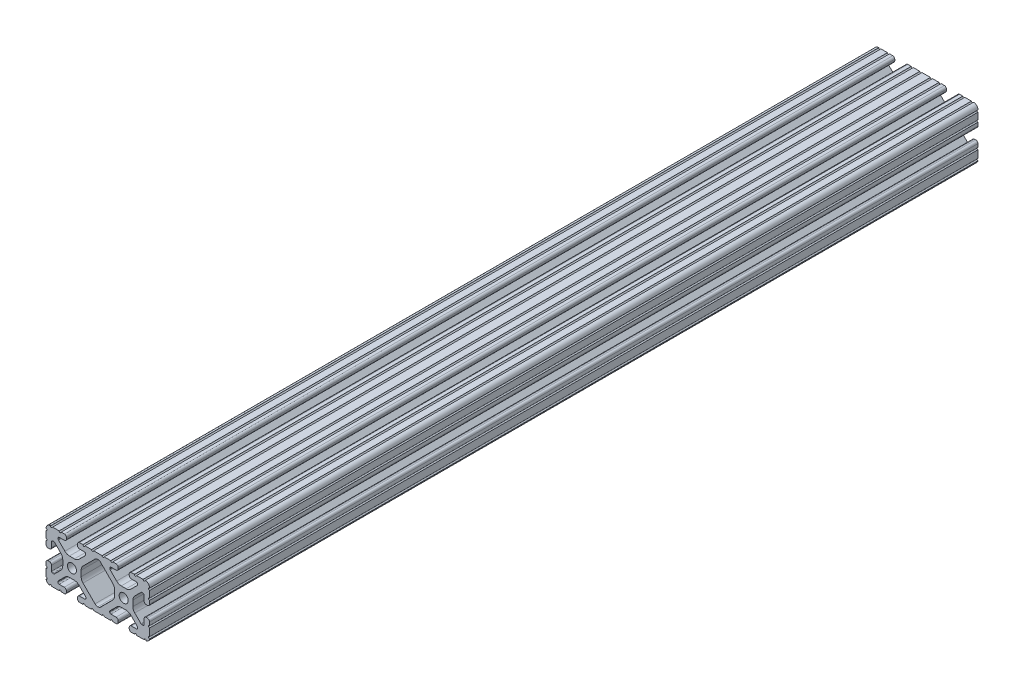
from build123d import *

# Parameters (mm, degrees)
SKETCH1_R      = 3.3274
EXTRUDE1_DEPTH = 609.6
SKETCH3_R      = 3.571875
EXTRUDE3_DEPTH = 76.2


with BuildPart() as part:
    # Sketch1 → Extrude1 (new body)
    with BuildSketch(Plane.XY):
        with BuildLine():
            Line((37.1900335, 54.320138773), (37.1900335, 54.882716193))
            ThreePointArc((37.1900335, 54.882716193), (37.450415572, 55.511334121), (38.0790335, 55.771716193))
            Line((38.0790335, 55.771716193), (41.685477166, 55.771716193))
            ThreePointArc((41.685477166, 55.771716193), (42.799028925, 56.232964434), (43.260277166, 57.346516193))
            Line((43.260277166, 57.346516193), (43.260277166, 58.282488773))
            ThreePointArc((43.260277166, 58.282488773), (42.805347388, 59.380786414), (41.707049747, 59.835716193))
            Line((41.707049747, 59.835716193), (39.271813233, 59.835716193))
            ThreePointArc((39.271813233, 59.835716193), (38.509813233, 59.073716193), (37.747813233, 59.835716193))
            Line((37.747813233, 59.835716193), (32.919398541, 59.835716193))
            ThreePointArc((32.919398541, 59.835716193), (32.157398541, 59.073716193), (31.395398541, 59.835716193))
            Line((31.395398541, 59.835716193), (25.153155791, 59.835716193))
            ThreePointArc((25.153155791, 59.835716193), (24.391155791, 59.073716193), (23.629155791, 59.835716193))
            Line((23.629155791, 59.835716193), (18.800741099, 59.835716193))
            ThreePointArc((18.800741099, 59.835716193), (18.038741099, 59.073716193), (17.276741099, 59.835716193))
            Line((17.276741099, 59.835716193), (14.841504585, 59.835716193))
            ThreePointArc((14.841504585, 59.835716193), (13.743206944, 59.380786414), (13.288277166, 58.282488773))
            Line((13.288277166, 58.282488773), (13.288277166, 57.346516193))
            ThreePointArc((13.288277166, 57.346516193), (13.749525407, 56.232964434), (14.863077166, 55.771716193))
            Line((14.863077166, 55.771716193), (18.469520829, 55.771716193))
            ThreePointArc((18.469520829, 55.771716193), (19.098138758, 55.511334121), (19.358520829, 54.882716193))
            Line((19.358520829, 54.882716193), (19.358520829, 54.320138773))
            ThreePointArc((19.358520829, 54.320138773), (19.290850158, 53.979934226), (19.098140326, 53.691522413))
            Line((19.098140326, 53.691522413), (14.421778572, 49.015137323))
            ThreePointArc((14.421778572, 49.015137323), (12.880829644, 47.985503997), (11.063154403, 47.623944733))
            Line((11.063154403, 47.623944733), (7.38539993, 47.623944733))
            ThreePointArc((7.38539993, 47.623944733), (5.567724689, 47.985503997), (4.026775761, 49.015137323))
            Line((4.026775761, 49.015137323), (-0.649585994, 53.691522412))
            ThreePointArc((-0.649585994, 53.691522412), (-0.842295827, 53.979934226), (-0.909966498, 54.320138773))
            Line((-0.909966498, 54.320138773), (-0.909966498, 54.882716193))
            ThreePointArc((-0.909966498, 54.882716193), (-0.649584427, 55.511334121), (-0.020966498, 55.771716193))
            Line((-0.020966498, 55.771716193), (3.585477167, 55.771716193))
            ThreePointArc((3.585477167, 55.771716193), (4.699028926, 56.232964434), (5.160277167, 57.346516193))
            Line((5.160277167, 57.346516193), (5.160277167, 58.266281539))
            ThreePointArc((5.160277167, 58.266281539), (4.744040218, 59.332924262), (3.715361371, 59.835716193))
            Line((3.715361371, 59.835716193), (1.328459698, 59.835716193))
            ThreePointArc((1.328459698, 59.835716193), (0.566459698, 59.073716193), (-0.195540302, 59.835716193))
            Line((-0.195540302, 59.835716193), (-5.021979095, 59.835716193))
            ThreePointArc((-5.021979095, 59.835716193), (-5.807035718, 59.097492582), (-6.545259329, 59.882549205))
            ThreePointArc((-6.545259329, 59.882549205), (-8.87374186, 58.977730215), (-9.863337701, 56.683993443))
            ThreePointArc((-9.863337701, 56.683993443), (-9.063955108, 55.941735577), (-9.825722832, 55.160922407))
            Line((-9.825722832, 55.160922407), (-9.825722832, 50.335417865))
            ThreePointArc((-9.825722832, 50.335417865), (-9.063722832, 49.573417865), (-9.825722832, 48.811417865))
            Line((-9.825722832, 48.811417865), (-9.825722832, 46.424516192))
            ThreePointArc((-9.825722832, 46.424516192), (-9.364474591, 45.310964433), (-8.250922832, 44.849716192))
            Line((-8.250922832, 44.849716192), (-7.336522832, 44.849716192))
            ThreePointArc((-7.336522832, 44.849716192), (-6.222971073, 45.310964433), (-5.761722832, 46.424516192))
            Line((-5.761722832, 46.424516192), (-5.761722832, 50.183716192))
            ThreePointArc((-5.761722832, 50.183716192), (-5.50134076, 50.81233412), (-4.872722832, 51.072716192))
            Line((-4.872722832, 51.072716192), (-4.146379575, 51.072716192))
            ThreePointArc((-4.146379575, 51.072716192), (-3.806172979, 51.005044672), (-3.517760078, 50.812332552))
            Line((-3.517760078, 50.812332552), (1.076701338, 46.217848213))
            ThreePointArc((1.076701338, 46.217848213), (2.10632244, 44.676905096), (2.467877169, 42.859240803))
            Line((2.467877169, 42.859240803), (2.467877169, 38.712191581))
            ThreePointArc((2.467877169, 38.712191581), (2.10632244, 36.894527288), (1.076701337, 35.353584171))
            Line((1.076701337, 35.353584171), (-3.517760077, 30.759099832))
            ThreePointArc((-3.517760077, 30.759099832), (-3.806172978, 30.566387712), (-4.146379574, 30.498716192))
            Line((-4.146379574, 30.498716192), (-4.872722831, 30.498716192))
            ThreePointArc((-4.872722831, 30.498716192), (-5.501340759, 30.759098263), (-5.761722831, 31.387716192))
            Line((-5.761722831, 31.387716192), (-5.761722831, 35.146916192))
            ThreePointArc((-5.761722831, 35.146916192), (-6.222971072, 36.260467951), (-7.336522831, 36.721716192))
            Line((-7.336522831, 36.721716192), (-8.250922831, 36.721716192))
            ThreePointArc((-8.250922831, 36.721716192), (-9.36447459, 36.260467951), (-9.825722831, 35.146916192))
            Line((-9.825722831, 35.146916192), (-9.825722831, 32.760014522))
            ThreePointArc((-9.825722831, 32.760014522), (-9.063722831, 31.998014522), (-9.825722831, 31.236014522))
            Line((-9.825722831, 31.236014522), (-9.825722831, 25.74969698))
            ThreePointArc((-9.825722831, 25.74969698), (-9.063722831, 24.98769698), (-9.825722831, 24.22569698))
            ThreePointArc((-9.825722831, 24.22569698), (-8.934545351, 22.601713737), (-7.296996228, 21.735716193))
            ThreePointArc((-7.296996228, 21.735716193), (-6.534996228, 22.497716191), (-5.77299623, 21.735716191))
            Line((-5.77299623, 21.735716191), (-0.195540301, 21.735716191))
            ThreePointArc((-0.195540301, 21.735716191), (0.566459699, 22.497716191), (1.328459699, 21.735716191))
            Line((1.328459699, 21.735716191), (3.585477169, 21.735716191))
            ThreePointArc((3.585477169, 21.735716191), (4.699028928, 22.196964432), (5.160277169, 23.310516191))
            Line((5.160277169, 23.310516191), (5.160277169, 24.224916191))
            ThreePointArc((5.160277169, 24.224916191), (4.699028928, 25.33846795), (3.585477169, 25.799716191))
            Line((3.585477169, 25.799716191), (-0.173722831, 25.799716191))
            ThreePointArc((-0.173722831, 25.799716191), (-0.80234076, 26.060098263), (-1.062722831, 26.688716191))
            Line((-1.062722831, 26.688716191), (-1.062722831, 27.098536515))
            ThreePointArc((-1.062722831, 27.098536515), (-0.99505216, 27.438741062), (-0.802342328, 27.727152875))
            Line((-0.802342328, 27.727152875), (4.026775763, 32.556295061))
            ThreePointArc((4.026775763, 32.556295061), (5.567724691, 33.585928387), (7.385399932, 33.947487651))
            Line((7.385399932, 33.947487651), (11.063154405, 33.947487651))
            ThreePointArc((11.063154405, 33.947487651), (12.880829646, 33.585928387), (14.421778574, 32.556295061))
            Line((14.421778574, 32.556295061), (19.250896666, 27.727152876))
            ThreePointArc((19.250896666, 27.727152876), (19.443606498, 27.438741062), (19.511277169, 27.098536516))
            Line((19.511277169, 27.098536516), (19.511277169, 26.688716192))
            ThreePointArc((19.511277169, 26.688716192), (19.250895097, 26.060098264), (18.622277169, 25.799716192))
            Line((18.622277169, 25.799716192), (14.863077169, 25.799716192))
            ThreePointArc((14.863077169, 25.799716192), (13.74952541, 25.338467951), (13.288277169, 24.224916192))
            Line((13.288277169, 24.224916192), (13.288277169, 23.310516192))
            ThreePointArc((13.288277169, 23.310516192), (13.74952541, 22.196964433), (14.863077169, 21.735716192))
            Line((14.863077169, 21.735716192), (17.276741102, 21.735716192))
            ThreePointArc((17.276741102, 21.735716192), (18.038741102, 22.497716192), (18.800741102, 21.735716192))
            Line((18.800741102, 21.735716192), (23.629155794, 21.735716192))
            ThreePointArc((23.629155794, 21.735716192), (24.391155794, 22.497716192), (25.153155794, 21.735716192))
            Line((25.153155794, 21.735716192), (31.395398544, 21.735716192))
            ThreePointArc((31.395398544, 21.735716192), (32.157398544, 22.497716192), (32.919398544, 21.735716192))
            Line((32.919398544, 21.735716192), (37.747813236, 21.735716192))
            ThreePointArc((37.747813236, 21.735716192), (38.509813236, 22.497716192), (39.271813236, 21.735716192))
            Line((39.271813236, 21.735716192), (41.685477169, 21.735716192))
            ThreePointArc((41.685477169, 21.735716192), (42.799028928, 22.196964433), (43.260277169, 23.310516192))
            Line((43.260277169, 23.310516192), (43.260277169, 24.224916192))
            ThreePointArc((43.260277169, 24.224916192), (42.799028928, 25.338467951), (41.685477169, 25.799716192))
            Line((41.685477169, 25.799716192), (37.926277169, 25.799716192))
            ThreePointArc((37.926277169, 25.799716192), (37.29765924, 26.060098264), (37.037277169, 26.688716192))
            Line((37.037277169, 26.688716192), (37.037277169, 27.098536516))
            ThreePointArc((37.037277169, 27.098536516), (37.10494784, 27.438741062), (37.297657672, 27.727152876))
            Line((37.297657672, 27.727152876), (42.126775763, 32.556295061))
            ThreePointArc((42.126775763, 32.556295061), (43.667724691, 33.585928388), (45.485399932, 33.947487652))
            Line((45.485399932, 33.947487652), (49.163154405, 33.947487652))
            ThreePointArc((49.163154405, 33.947487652), (50.980829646, 33.585928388), (52.521778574, 32.556295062))
            Line((52.521778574, 32.556295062), (57.350896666, 27.727152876))
            ThreePointArc((57.350896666, 27.727152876), (57.543606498, 27.438741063), (57.611277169, 27.098536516))
            Line((57.611277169, 27.098536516), (57.611277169, 26.688716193))
            ThreePointArc((57.611277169, 26.688716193), (57.350895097, 26.060098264), (56.722277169, 25.799716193))
            Line((56.722277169, 25.799716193), (52.963077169, 25.799716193))
            ThreePointArc((52.963077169, 25.799716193), (51.84952541, 25.338467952), (51.388277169, 24.224916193))
            Line((51.388277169, 24.224916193), (51.388277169, 23.310516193))
            ThreePointArc((51.388277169, 23.310516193), (51.84952541, 22.196964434), (52.963077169, 21.735716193))
            Line((52.963077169, 21.735716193), (55.220094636, 21.735716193))
            ThreePointArc((55.220094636, 21.735716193), (55.982094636, 22.497716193), (56.744094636, 21.735716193))
            Line((56.744094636, 21.735716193), (62.321550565, 21.735716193))
            ThreePointArc((62.321550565, 21.735716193), (63.083550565, 22.497716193), (63.845550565, 21.735716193))
            ThreePointArc((63.845550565, 21.735716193), (65.481854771, 22.602978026), (66.374277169, 24.225696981))
            ThreePointArc((66.374277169, 24.225696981), (65.612277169, 24.987696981), (66.374277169, 25.749696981))
            Line((66.374277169, 25.749696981), (66.374277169, 31.236014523))
            ThreePointArc((66.374277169, 31.236014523), (65.612277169, 31.998014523), (66.374277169, 32.760014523))
            Line((66.374277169, 32.760014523), (66.374277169, 35.146916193))
            ThreePointArc((66.374277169, 35.146916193), (65.913028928, 36.260467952), (64.799477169, 36.721716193))
            Line((64.799477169, 36.721716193), (63.885077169, 36.721716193))
            ThreePointArc((63.885077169, 36.721716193), (62.77152541, 36.260467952), (62.310277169, 35.146916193))
            Line((62.310277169, 35.146916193), (62.310277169, 31.387716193))
            ThreePointArc((62.310277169, 31.387716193), (62.049895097, 30.759098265), (61.421277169, 30.498716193))
            Line((61.421277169, 30.498716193), (60.694933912, 30.498716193))
            ThreePointArc((60.694933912, 30.498716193), (60.354727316, 30.566387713), (60.066314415, 30.759099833))
            Line((60.066314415, 30.759099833), (55.471853, 35.353584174))
            ThreePointArc((55.471853, 35.353584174), (54.442231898, 36.894527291), (54.08067717, 38.712191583))
            Line((54.08067717, 38.712191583), (54.08067717, 42.859240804))
            ThreePointArc((54.08067717, 42.859240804), (54.442231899, 44.676905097), (55.471853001, 46.217848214))
            Line((55.471853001, 46.217848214), (60.066314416, 50.812332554))
            ThreePointArc((60.066314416, 50.812332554), (60.354727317, 51.005044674), (60.694933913, 51.072716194))
            Line((60.694933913, 51.072716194), (61.42127717, 51.072716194))
            ThreePointArc((61.42127717, 51.072716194), (62.049895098, 50.812334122), (62.31027717, 50.183716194))
            Line((62.31027717, 50.183716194), (62.31027717, 46.424516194))
            ThreePointArc((62.31027717, 46.424516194), (62.771525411, 45.310964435), (63.88507717, 44.849716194))
            Line((63.88507717, 44.849716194), (64.79947717, 44.849716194))
            ThreePointArc((64.79947717, 44.849716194), (65.913028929, 45.310964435), (66.37427717, 46.424516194))
            Line((66.37427717, 46.424516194), (66.37427717, 48.811417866))
            ThreePointArc((66.37427717, 48.811417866), (65.61227717, 49.573417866), (66.37427717, 50.335417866))
            Line((66.37427717, 50.335417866), (66.37427717, 55.160922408))
            ThreePointArc((66.37427717, 55.160922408), (65.612509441, 55.941735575), (66.411892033, 56.683993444))
            ThreePointArc((66.411892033, 56.683993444), (65.422296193, 58.977730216), (63.093813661, 59.882549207))
            ThreePointArc((63.093813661, 59.882549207), (62.355590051, 59.097492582), (61.570533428, 59.835716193))
            Line((61.570533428, 59.835716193), (56.744094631, 59.835716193))
            ThreePointArc((56.744094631, 59.835716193), (55.982094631, 59.073716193), (55.220094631, 59.835716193))
            Line((55.220094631, 59.835716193), (52.833192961, 59.835716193))
            ThreePointArc((52.833192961, 59.835716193), (51.804514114, 59.332924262), (51.388277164, 58.266281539))
            Line((51.388277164, 58.266281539), (51.388277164, 57.346516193))
            ThreePointArc((51.388277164, 57.346516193), (51.849525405, 56.232964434), (52.963077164, 55.771716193))
            Line((52.963077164, 55.771716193), (56.569520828, 55.771716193))
            ThreePointArc((56.569520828, 55.771716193), (57.198138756, 55.511334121), (57.458520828, 54.882716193))
            Line((57.458520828, 54.882716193), (57.458520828, 54.320138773))
            ThreePointArc((57.458520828, 54.320138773), (57.390850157, 53.979934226), (57.198140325, 53.691522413))
            Line((57.198140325, 53.691522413), (52.52177857, 49.015137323))
            ThreePointArc((52.52177857, 49.015137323), (50.980829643, 47.985503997), (49.163154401, 47.623944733))
            Line((49.163154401, 47.623944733), (45.485399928, 47.623944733))
            ThreePointArc((45.485399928, 47.623944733), (43.667724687, 47.985503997), (42.12677576, 49.015137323))
            Line((42.12677576, 49.015137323), (37.450414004, 53.691522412))
            ThreePointArc((37.450414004, 53.691522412), (37.257704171, 53.979934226), (37.1900335, 54.320138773))
        make_face()
        with Locations(Location((47.324277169, 40.785716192, 0), (0, 0, 180))):
            Circle(SKETCH1_R, mode=Mode.SUBTRACT)
        with Locations(Location((9.224277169, 40.785716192, 0), (0, 0, 180))):
            Circle(SKETCH1_R, mode=Mode.SUBTRACT)
        with BuildLine():
            Line((30.35131253, 26.52815133), (39.176701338, 35.353584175))
            ThreePointArc((39.176701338, 35.353584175), (40.206322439, 36.894527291), (40.567877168, 38.712191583))
            Line((40.567877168, 38.712191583), (40.567877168, 42.859240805))
            ThreePointArc((40.567877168, 42.859240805), (40.206322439, 44.676905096), (39.176701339, 46.217848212))
            Line((39.176701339, 46.217848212), (30.35131253, 55.043281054))
            ThreePointArc((30.35131253, 55.043281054), (29.39832277, 55.678689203), (28.274277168, 55.898812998))
            ThreePointArc((28.274277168, 55.898812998), (27.150231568, 55.678689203), (26.197241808, 55.043281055))
            Line((26.197241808, 55.043281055), (17.371853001, 46.217848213))
            ThreePointArc((17.371853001, 46.217848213), (16.342231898, 44.676905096), (15.980677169, 42.859240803))
            Line((15.980677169, 42.859240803), (15.980677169, 38.712191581))
            ThreePointArc((15.980677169, 38.712191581), (16.342231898, 36.894527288), (17.371853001, 35.353584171))
            Line((17.371853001, 35.353584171), (26.197241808, 26.528151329))
            ThreePointArc((26.197241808, 26.528151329), (27.150231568, 25.892743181), (28.274277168, 25.672619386))
            ThreePointArc((28.274277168, 25.672619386), (29.39832277, 25.892743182), (30.35131253, 26.52815133))
        make_face(mode=Mode.SUBTRACT)
    extrude(amount=EXTRUDE1_DEPTH)

    # Sketch3 → Extrude3 (cut)
    with BuildSketch(Plane(origin=(66.37427717, 0, 0), x_dir=(0, 0, -1), z_dir=(1, 0, 0))):
        with Locations(Location((-19.05, 40.833625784, 0), (0, 0, 34.548338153))):
            Circle(SKETCH3_R)
        with Locations(Location((-57.15, 40.833625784, 0), (0, 0, 145.451661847))):
            Circle(SKETCH3_R)
        with Locations(Location((-590.55, 40.833625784, 0), (0, 0, 145.451661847))):
            Circle(SKETCH3_R)
        with Locations(Location((-552.45, 40.785716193, 0), (0, 0, 35.486725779))):
            Circle(SKETCH3_R)
    extrude(amount=-EXTRUDE3_DEPTH, mode=Mode.SUBTRACT)


solid = part.part
